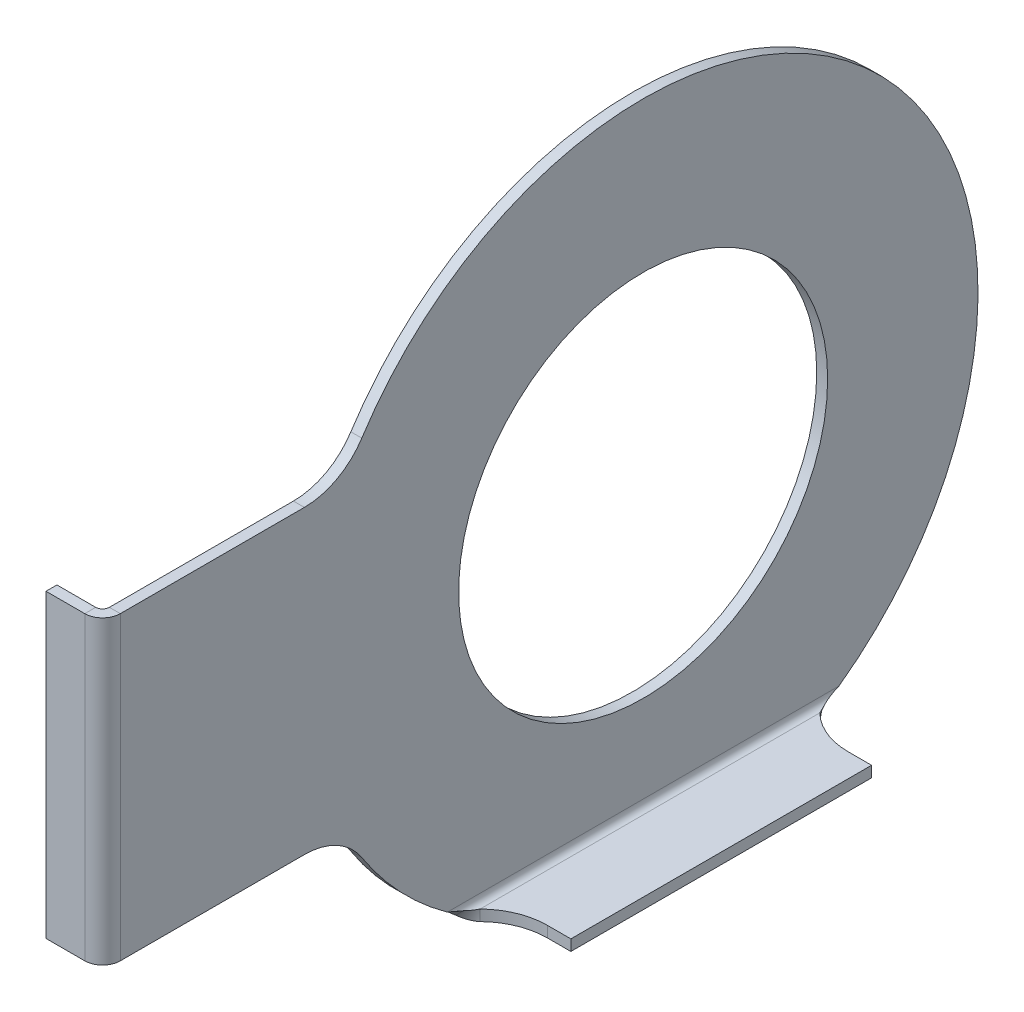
ISO-10303-21;
HEADER;
FILE_DESCRIPTION(('STEP AP214'),'2;1');
FILE_NAME('part.step','',(''),(''),'','','');
FILE_SCHEMA(('AUTOMOTIVE_DESIGN { 1 0 10303 214 1 1 1 1 }'));
ENDSEC;
DATA;
#1=APPLICATION_CONTEXT('core data for automotive mechanical design processes');
#2=APPLICATION_PROTOCOL_DEFINITION('international standard','automotive_design',2000,#1);
#3=PRODUCT_CONTEXT('',#1,'mechanical');
#4=PRODUCT('Part','Part','',(#3));
#5=PRODUCT_RELATED_PRODUCT_CATEGORY('part','',(#4));
#6=PRODUCT_DEFINITION_FORMATION('','',#4);
#7=PRODUCT_DEFINITION_CONTEXT('part definition',#1,'design');
#8=PRODUCT_DEFINITION('design','',#6,#7);
#9=PRODUCT_DEFINITION_SHAPE('','',#8);
#10=(LENGTH_UNIT() NAMED_UNIT(*) SI_UNIT(.MILLI.,.METRE.));
#11=(NAMED_UNIT(*) PLANE_ANGLE_UNIT() SI_UNIT($,.RADIAN.));
#12=(NAMED_UNIT(*) SI_UNIT($,.STERADIAN.) SOLID_ANGLE_UNIT());
#13=UNCERTAINTY_MEASURE_WITH_UNIT(LENGTH_MEASURE(1.E-05),#10,'distance_accuracy_value','');
#14=(GEOMETRIC_REPRESENTATION_CONTEXT(3) GLOBAL_UNCERTAINTY_ASSIGNED_CONTEXT((#13)) GLOBAL_UNIT_ASSIGNED_CONTEXT((#10,
#11,#12)) REPRESENTATION_CONTEXT('',''));
#15=CARTESIAN_POINT('',(0.,0.,0.));
#16=DIRECTION('',(0.,0.,1.));
#17=DIRECTION('',(1.,0.,0.));
#18=AXIS2_PLACEMENT_3D('',#15,#16,#17);
#19=CARTESIAN_POINT('',(0.,32.,49.5681349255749));
#20=DIRECTION('',(-1.,0.,0.));
#21=DIRECTION('',(0.,0.,1.));
#22=AXIS2_PLACEMENT_3D('',#19,#20,#21);
#23=PLANE('',#22);
#24=CARTESIAN_POINT('',(0.,0.,0.));
#25=DIRECTION('',(1.,0.,0.));
#26=DIRECTION('',(0.,0.,-1.));
#27=AXIS2_PLACEMENT_3D('',#24,#25,#26);
#28=CIRCLE('',#27,27.);
#29=CARTESIAN_POINT('',(0.,0.,-27.));
#30=VERTEX_POINT('',#29);
#31=EDGE_CURVE('E659',#30,#30,#28,.T.);
#32=ORIENTED_EDGE('',*,*,#31,.T.);
#33=EDGE_LOOP('',(#32));
#34=FACE_BOUND('',#33,.T.);
#35=DIRECTION('',(0.,0.,-1.));
#36=VECTOR('',#35,1.);
#37=CARTESIAN_POINT('',(0.,-22.,49.5681349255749));
#38=LINE('',#37,#36);
#39=CARTESIAN_POINT('',(0.,-22.,76.5));
#40=VERTEX_POINT('',#39);
#41=CARTESIAN_POINT('',(0.,-22.,49.5681349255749));
#42=VERTEX_POINT('',#41);
#43=EDGE_CURVE('E85',#40,#42,#38,.T.);
#44=ORIENTED_EDGE('',*,*,#43,.F.);
#45=DIRECTION('',(0.,1.,0.));
#46=VECTOR('',#45,1.);
#47=CARTESIAN_POINT('',(0.,32.,76.5));
#48=LINE('',#47,#46);
#49=CARTESIAN_POINT('',(0.,22.,76.5));
#50=VERTEX_POINT('',#49);
#51=EDGE_CURVE('E77',#40,#50,#48,.T.);
#52=ORIENTED_EDGE('',*,*,#51,.T.);
#53=DIRECTION('',(0.,0.,1.));
#54=VECTOR('',#53,1.);
#55=CARTESIAN_POINT('',(0.,22.,49.5681349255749));
#56=LINE('',#55,#54);
#57=CARTESIAN_POINT('',(0.,22.,49.5681349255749));
#58=VERTEX_POINT('',#57);
#59=EDGE_CURVE('E93',#58,#50,#56,.T.);
#60=ORIENTED_EDGE('',*,*,#59,.F.);
#61=CARTESIAN_POINT('',(0.,32.,49.5681349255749));
#62=DIRECTION('',(-1.,0.,0.));
#63=DIRECTION('',(0.,0.,1.));
#64=AXIS2_PLACEMENT_3D('',#61,#62,#63);
#65=CIRCLE('',#64,10.);
#66=CARTESIAN_POINT('',(0.,26.5762711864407,41.16675612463));
#67=VERTEX_POINT('',#66);
#68=EDGE_CURVE('E635',#67,#58,#65,.T.);
#69=ORIENTED_EDGE('',*,*,#68,.F.);
#70=CARTESIAN_POINT('',(0.,0.,0.));
#71=DIRECTION('',(1.,0.,0.));
#72=DIRECTION('',(0.,0.,-1.));
#73=AXIS2_PLACEMENT_3D('',#70,#71,#72);
#74=CIRCLE('',#73,49.);
#75=CARTESIAN_POINT('',(0.,-39.75,-28.6520069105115));
#76=VERTEX_POINT('',#75);
#77=EDGE_CURVE('E525',#76,#67,#74,.T.);
#78=ORIENTED_EDGE('',*,*,#77,.F.);
#79=DIRECTION('',(0.,0.,1.));
#80=VECTOR('',#79,1.);
#81=CARTESIAN_POINT('',(0.,-39.75,49.5681349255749));
#82=LINE('',#81,#80);
#83=CARTESIAN_POINT('',(0.,-39.75,28.6520069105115));
#84=VERTEX_POINT('',#83);
#85=EDGE_CURVE('E491',#76,#84,#82,.T.);
#86=ORIENTED_EDGE('',*,*,#85,.T.);
#87=CARTESIAN_POINT('',(0.,0.,0.));
#88=DIRECTION('',(1.,0.,0.));
#89=DIRECTION('',(0.,0.,-1.));
#90=AXIS2_PLACEMENT_3D('',#87,#88,#89);
#91=CIRCLE('',#90,49.);
#92=CARTESIAN_POINT('',(0.,-26.5762711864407,41.16675612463));
#93=VERTEX_POINT('',#92);
#94=EDGE_CURVE('E650',#93,#84,#91,.T.);
#95=ORIENTED_EDGE('',*,*,#94,.F.);
#96=CARTESIAN_POINT('',(0.,-32.,49.5681349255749));
#97=DIRECTION('',(-1.,0.,0.));
#98=DIRECTION('',(0.,0.,-1.));
#99=AXIS2_PLACEMENT_3D('',#96,#97,#98);
#100=CIRCLE('',#99,10.);
#101=EDGE_CURVE('E477',#42,#93,#100,.T.);
#102=ORIENTED_EDGE('',*,*,#101,.F.);
#103=EDGE_LOOP('',(#44,#52,#60,#69,#78,#86,#95,#102));
#104=FACE_BOUND('',#103,.T.);
#105=ADVANCED_FACE('F68',(#34,#104),#23,.T.);
#106=CARTESIAN_POINT('',(9.59070153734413,-40.75,-32.));
#107=DIRECTION('',(0.,-1.,0.));
#108=DIRECTION('',(0.,0.,1.));
#109=AXIS2_PLACEMENT_3D('',#106,#107,#108);
#110=CYLINDRICAL_SURFACE('',#109,10.);
#111=CARTESIAN_POINT('',(9.59070153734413,-42.35,-32.));
#112=DIRECTION('',(0.,-1.,0.));
#113=DIRECTION('',(0.,0.,-1.));
#114=AXIS2_PLACEMENT_3D('',#111,#112,#113);
#115=CIRCLE('',#114,10.);
#116=CARTESIAN_POINT('',(9.59070153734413,-42.35,-22.));
#117=VERTEX_POINT('',#116);
#118=CARTESIAN_POINT('',(2.60000000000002,-42.35,-24.8494691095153));
#119=VERTEX_POINT('',#118);
#120=EDGE_CURVE('E544',#117,#119,#115,.T.);
#121=ORIENTED_EDGE('',*,*,#120,.T.);
#122=CARTESIAN_POINT('',(2.60000000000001,-40.75,-24.8494691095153));
#123=CARTESIAN_POINT('',(2.60000000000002,-42.35,-24.8494691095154));
#124=B_SPLINE_CURVE_WITH_KNOTS('',1,(#122,#123),.UNSPECIFIED.,.F.,.F.,(2,2),(0.,1.),.UNSPECIFIED.);
#125=CARTESIAN_POINT('',(2.60000000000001,-40.75,-24.8494691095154));
#126=VERTEX_POINT('',#125);
#127=EDGE_CURVE('E340',#119,#126,#124,.F.);
#128=ORIENTED_EDGE('',*,*,#127,.T.);
#129=CARTESIAN_POINT('',(9.59070153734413,-40.75,-32.));
#130=DIRECTION('',(0.,-1.,0.));
#131=DIRECTION('',(0.,0.,-1.));
#132=AXIS2_PLACEMENT_3D('',#129,#130,#131);
#133=CIRCLE('',#132,10.);
#134=CARTESIAN_POINT('',(9.59070153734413,-40.75,-22.));
#135=VERTEX_POINT('',#134);
#136=EDGE_CURVE('E536',#135,#126,#133,.T.);
#137=ORIENTED_EDGE('',*,*,#136,.F.);
#138=DIRECTION('',(0.,-1.,0.));
#139=VECTOR('',#138,1.);
#140=CARTESIAN_POINT('',(9.59070153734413,-40.75,-22.));
#141=LINE('',#140,#139);
#142=EDGE_CURVE('E545',#135,#117,#141,.T.);
#143=ORIENTED_EDGE('',*,*,#142,.T.);
#144=EDGE_LOOP('',(#121,#128,#137,#143));
#145=FACE_BOUND('',#144,.T.);
#146=ADVANCED_FACE('F576',(#145),#110,.F.);
#147=CARTESIAN_POINT('',(9.59070153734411,-40.75,32.));
#148=DIRECTION('',(0.,-1.,0.));
#149=DIRECTION('',(0.,0.,1.));
#150=AXIS2_PLACEMENT_3D('',#147,#148,#149);
#151=CYLINDRICAL_SURFACE('',#150,10.);
#152=CARTESIAN_POINT('',(9.59070153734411,-40.75,32.));
#153=DIRECTION('',(0.,-1.,0.));
#154=DIRECTION('',(0.,0.,-1.));
#155=AXIS2_PLACEMENT_3D('',#152,#153,#154);
#156=CIRCLE('',#155,10.);
#157=CARTESIAN_POINT('',(2.6,-40.75,24.8494691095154));
#158=VERTEX_POINT('',#157);
#159=CARTESIAN_POINT('',(9.59070153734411,-40.75,22.));
#160=VERTEX_POINT('',#159);
#161=EDGE_CURVE('E532',#158,#160,#156,.T.);
#162=ORIENTED_EDGE('',*,*,#161,.F.);
#163=CARTESIAN_POINT('',(2.60000000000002,-42.35,24.8494691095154));
#164=CARTESIAN_POINT('',(2.60000000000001,-40.75,24.8494691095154));
#165=B_SPLINE_CURVE_WITH_KNOTS('',1,(#163,#164),.UNSPECIFIED.,.F.,.F.,(2,2),(0.,1.),.UNSPECIFIED.);
#166=CARTESIAN_POINT('',(2.60000000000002,-42.35,24.8494691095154));
#167=VERTEX_POINT('',#166);
#168=EDGE_CURVE('E413',#158,#167,#165,.F.);
#169=ORIENTED_EDGE('',*,*,#168,.T.);
#170=CARTESIAN_POINT('',(9.59070153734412,-42.35,32.));
#171=DIRECTION('',(0.,-1.,0.));
#172=DIRECTION('',(0.,0.,-1.));
#173=AXIS2_PLACEMENT_3D('',#170,#171,#172);
#174=CIRCLE('',#173,10.);
#175=CARTESIAN_POINT('',(9.59070153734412,-42.35,22.));
#176=VERTEX_POINT('',#175);
#177=EDGE_CURVE('E540',#167,#176,#174,.T.);
#178=ORIENTED_EDGE('',*,*,#177,.T.);
#179=DIRECTION('',(0.,-1.,0.));
#180=VECTOR('',#179,1.);
#181=CARTESIAN_POINT('',(9.59070153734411,-40.75,22.));
#182=LINE('',#181,#180);
#183=EDGE_CURVE('E554',#160,#176,#182,.T.);
#184=ORIENTED_EDGE('',*,*,#183,.F.);
#185=EDGE_LOOP('',(#162,#169,#178,#184));
#186=FACE_BOUND('',#185,.T.);
#187=ADVANCED_FACE('F586',(#186),#151,.F.);
#188=CARTESIAN_POINT('',(-71.9774333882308,-40.7500000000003,49.5681349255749));
#189=DIRECTION('',(0.,-1.,0.));
#190=DIRECTION('',(0.,0.,1.));
#191=AXIS2_PLACEMENT_3D('',#188,#189,#190);
#192=PLANE('',#191);
#193=ORIENTED_EDGE('',*,*,#136,.T.);
#194=DIRECTION('',(0.,0.,1.));
#195=VECTOR('',#194,1.);
#196=CARTESIAN_POINT('',(2.59999999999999,-40.75,49.5681349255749));
#197=LINE('',#196,#195);
#198=EDGE_CURVE('E557',#126,#158,#197,.T.);
#199=ORIENTED_EDGE('',*,*,#198,.T.);
#200=ORIENTED_EDGE('',*,*,#161,.T.);
#201=DIRECTION('',(1.,0.,0.));
#202=VECTOR('',#201,1.);
#203=CARTESIAN_POINT('',(9.59070153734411,-40.75,22.));
#204=LINE('',#203,#202);
#205=CARTESIAN_POINT('',(13.0225666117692,-40.75,22.));
#206=VERTEX_POINT('',#205);
#207=EDGE_CURVE('E529',#160,#206,#204,.T.);
#208=ORIENTED_EDGE('',*,*,#207,.T.);
#209=DIRECTION('',(0.,0.,-1.));
#210=VECTOR('',#209,1.);
#211=CARTESIAN_POINT('',(13.0225666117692,-40.75,22.));
#212=LINE('',#211,#210);
#213=CARTESIAN_POINT('',(13.0225666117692,-40.75,-22.));
#214=VERTEX_POINT('',#213);
#215=EDGE_CURVE('E531',#206,#214,#212,.T.);
#216=ORIENTED_EDGE('',*,*,#215,.T.);
#217=DIRECTION('',(-1.,0.,0.));
#218=VECTOR('',#217,1.);
#219=CARTESIAN_POINT('',(9.59070153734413,-40.75,-22.));
#220=LINE('',#219,#218);
#221=EDGE_CURVE('E534',#214,#135,#220,.T.);
#222=ORIENTED_EDGE('',*,*,#221,.T.);
#223=EDGE_LOOP('',(#193,#199,#200,#208,#216,#222));
#224=FACE_BOUND('',#223,.T.);
#225=ADVANCED_FACE('F587',(#224),#192,.F.);
#226=CARTESIAN_POINT('',(-71.9774333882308,-42.3500000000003,49.5681349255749));
#227=DIRECTION('',(0.,-1.,0.));
#228=DIRECTION('',(0.,0.,1.));
#229=AXIS2_PLACEMENT_3D('',#226,#227,#228);
#230=PLANE('',#229);
#231=DIRECTION('',(0.,0.,1.));
#232=VECTOR('',#231,1.);
#233=CARTESIAN_POINT('',(2.6,-42.35,49.5681349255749));
#234=LINE('',#233,#232);
#235=EDGE_CURVE('E1003',#119,#167,#234,.T.);
#236=ORIENTED_EDGE('',*,*,#235,.F.);
#237=ORIENTED_EDGE('',*,*,#120,.F.);
#238=DIRECTION('',(-1.,0.,0.));
#239=VECTOR('',#238,1.);
#240=CARTESIAN_POINT('',(9.59070153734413,-42.35,-22.));
#241=LINE('',#240,#239);
#242=CARTESIAN_POINT('',(13.0225666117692,-42.35,-22.));
#243=VERTEX_POINT('',#242);
#244=EDGE_CURVE('E542',#243,#117,#241,.T.);
#245=ORIENTED_EDGE('',*,*,#244,.F.);
#246=DIRECTION('',(0.,0.,-1.));
#247=VECTOR('',#246,1.);
#248=CARTESIAN_POINT('',(13.0225666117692,-42.35,22.));
#249=LINE('',#248,#247);
#250=CARTESIAN_POINT('',(13.0225666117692,-42.35,22.));
#251=VERTEX_POINT('',#250);
#252=EDGE_CURVE('E539',#251,#243,#249,.T.);
#253=ORIENTED_EDGE('',*,*,#252,.F.);
#254=DIRECTION('',(1.,0.,0.));
#255=VECTOR('',#254,1.);
#256=CARTESIAN_POINT('',(9.59070153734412,-42.35,22.));
#257=LINE('',#256,#255);
#258=EDGE_CURVE('E537',#176,#251,#257,.T.);
#259=ORIENTED_EDGE('',*,*,#258,.F.);
#260=ORIENTED_EDGE('',*,*,#177,.F.);
#261=EDGE_LOOP('',(#236,#237,#245,#253,#259,#260));
#262=FACE_BOUND('',#261,.T.);
#263=ADVANCED_FACE('F589',(#262),#230,.T.);
#264=CARTESIAN_POINT('',(9.59070153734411,-40.75,22.));
#265=DIRECTION('',(0.,0.,-1.));
#266=DIRECTION('',(0.,-1.,0.));
#267=AXIS2_PLACEMENT_3D('',#264,#265,#266);
#268=PLANE('',#267);
#269=ORIENTED_EDGE('',*,*,#258,.T.);
#270=DIRECTION('',(0.,-1.,0.));
#271=VECTOR('',#270,1.);
#272=CARTESIAN_POINT('',(13.0225666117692,-40.75,22.));
#273=LINE('',#272,#271);
#274=EDGE_CURVE('E551',#206,#251,#273,.T.);
#275=ORIENTED_EDGE('',*,*,#274,.F.);
#276=ORIENTED_EDGE('',*,*,#207,.F.);
#277=ORIENTED_EDGE('',*,*,#183,.T.);
#278=EDGE_LOOP('',(#269,#275,#276,#277));
#279=FACE_BOUND('',#278,.T.);
#280=ADVANCED_FACE('F592',(#279),#268,.F.);
#281=CARTESIAN_POINT('',(13.0225666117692,-40.75,22.));
#282=DIRECTION('',(-1.,0.,0.));
#283=DIRECTION('',(0.,0.,1.));
#284=AXIS2_PLACEMENT_3D('',#281,#282,#283);
#285=PLANE('',#284);
#286=ORIENTED_EDGE('',*,*,#252,.T.);
#287=DIRECTION('',(0.,-1.,0.));
#288=VECTOR('',#287,1.);
#289=CARTESIAN_POINT('',(13.0225666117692,-40.75,-22.));
#290=LINE('',#289,#288);
#291=EDGE_CURVE('E548',#214,#243,#290,.T.);
#292=ORIENTED_EDGE('',*,*,#291,.F.);
#293=ORIENTED_EDGE('',*,*,#215,.F.);
#294=ORIENTED_EDGE('',*,*,#274,.T.);
#295=EDGE_LOOP('',(#286,#292,#293,#294));
#296=FACE_BOUND('',#295,.T.);
#297=ADVANCED_FACE('F680',(#296),#285,.F.);
#298=CARTESIAN_POINT('',(9.59070153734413,-40.75,-22.));
#299=DIRECTION('',(0.,0.,1.));
#300=DIRECTION('',(0.,1.,0.));
#301=AXIS2_PLACEMENT_3D('',#298,#299,#300);
#302=PLANE('',#301);
#303=ORIENTED_EDGE('',*,*,#244,.T.);
#304=ORIENTED_EDGE('',*,*,#142,.F.);
#305=ORIENTED_EDGE('',*,*,#221,.F.);
#306=ORIENTED_EDGE('',*,*,#291,.T.);
#307=EDGE_LOOP('',(#303,#304,#305,#306));
#308=FACE_BOUND('',#307,.T.);
#309=ADVANCED_FACE('F510',(#308),#302,.F.);
#310=CARTESIAN_POINT('',(1.6,0.,0.));
#311=DIRECTION('',(-1.,0.,0.));
#312=DIRECTION('',(0.,0.,1.));
#313=AXIS2_PLACEMENT_3D('',#310,#311,#312);
#314=CYLINDRICAL_SURFACE('',#313,27.);
#315=CARTESIAN_POINT('',(1.6,0.,0.));
#316=DIRECTION('',(1.,0.,0.));
#317=DIRECTION('',(0.,0.,-1.));
#318=AXIS2_PLACEMENT_3D('',#315,#316,#317);
#319=CIRCLE('',#318,27.);
#320=CARTESIAN_POINT('',(1.6,0.,-27.));
#321=VERTEX_POINT('',#320);
#322=EDGE_CURVE('E474',#321,#321,#319,.T.);
#323=ORIENTED_EDGE('',*,*,#322,.T.);
#324=EDGE_LOOP('',(#323));
#325=FACE_BOUND('',#324,.T.);
#326=ORIENTED_EDGE('',*,*,#31,.F.);
#327=EDGE_LOOP('',(#326));
#328=FACE_BOUND('',#327,.T.);
#329=ADVANCED_FACE('F673',(#325,#328),#314,.F.);
#330=CARTESIAN_POINT('',(1.6,-32.,49.5681349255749));
#331=DIRECTION('',(-1.,0.,0.));
#332=DIRECTION('',(0.,0.,1.));
#333=AXIS2_PLACEMENT_3D('',#330,#331,#332);
#334=CYLINDRICAL_SURFACE('',#333,10.);
#335=ORIENTED_EDGE('',*,*,#101,.T.);
#336=DIRECTION('',(-1.,0.,0.));
#337=VECTOR('',#336,1.);
#338=CARTESIAN_POINT('',(1.6,-26.5762711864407,41.16675612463));
#339=LINE('',#338,#337);
#340=CARTESIAN_POINT('',(1.6,-26.5762711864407,41.16675612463));
#341=VERTEX_POINT('',#340);
#342=EDGE_CURVE('E646',#341,#93,#339,.T.);
#343=ORIENTED_EDGE('',*,*,#342,.F.);
#344=CARTESIAN_POINT('',(1.6,-32.,49.5681349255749));
#345=DIRECTION('',(-1.,0.,0.));
#346=DIRECTION('',(0.,0.,-1.));
#347=AXIS2_PLACEMENT_3D('',#344,#345,#346);
#348=CIRCLE('',#347,10.);
#349=CARTESIAN_POINT('',(1.6,-22.,49.5681349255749));
#350=VERTEX_POINT('',#349);
#351=EDGE_CURVE('E526',#350,#341,#348,.T.);
#352=ORIENTED_EDGE('',*,*,#351,.F.);
#353=DIRECTION('',(-1.,0.,0.));
#354=VECTOR('',#353,1.);
#355=CARTESIAN_POINT('',(1.6,-22.,49.5681349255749));
#356=LINE('',#355,#354);
#357=EDGE_CURVE('E618',#350,#42,#356,.T.);
#358=ORIENTED_EDGE('',*,*,#357,.T.);
#359=EDGE_LOOP('',(#335,#343,#352,#358));
#360=FACE_BOUND('',#359,.T.);
#361=ADVANCED_FACE('F644',(#360),#334,.F.);
#362=CARTESIAN_POINT('',(1.6,-22.,49.5681349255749));
#363=DIRECTION('',(0.,1.,0.));
#364=DIRECTION('',(0.,0.,1.));
#365=AXIS2_PLACEMENT_3D('',#362,#363,#364);
#366=PLANE('',#365);
#367=DIRECTION('',(1.,0.,0.));
#368=VECTOR('',#367,1.);
#369=CARTESIAN_POINT('',(1.6,-22.,76.5));
#370=LINE('',#369,#368);
#371=CARTESIAN_POINT('',(1.6,-22.,76.5));
#372=VERTEX_POINT('',#371);
#373=EDGE_CURVE('E12',#40,#372,#370,.T.);
#374=ORIENTED_EDGE('',*,*,#373,.F.);
#375=ORIENTED_EDGE('',*,*,#43,.T.);
#376=ORIENTED_EDGE('',*,*,#357,.F.);
#377=DIRECTION('',(0.,0.,-1.));
#378=VECTOR('',#377,1.);
#379=CARTESIAN_POINT('',(1.6,-22.,49.5681349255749));
#380=LINE('',#379,#378);
#381=EDGE_CURVE('E72',#372,#350,#380,.T.);
#382=ORIENTED_EDGE('',*,*,#381,.F.);
#383=EDGE_LOOP('',(#374,#375,#376,#382));
#384=FACE_BOUND('',#383,.T.);
#385=ADVANCED_FACE('F70',(#384),#366,.F.);
#386=CARTESIAN_POINT('',(1.6,22.,49.5681349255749));
#387=DIRECTION('',(0.,-1.,0.));
#388=DIRECTION('',(0.,0.,-1.));
#389=AXIS2_PLACEMENT_3D('',#386,#387,#388);
#390=PLANE('',#389);
#391=DIRECTION('',(-1.,0.,0.));
#392=VECTOR('',#391,1.);
#393=CARTESIAN_POINT('',(1.6,22.,76.5));
#394=LINE('',#393,#392);
#395=CARTESIAN_POINT('',(1.6,22.,76.5));
#396=VERTEX_POINT('',#395);
#397=EDGE_CURVE('E613',#396,#50,#394,.T.);
#398=ORIENTED_EDGE('',*,*,#397,.F.);
#399=DIRECTION('',(0.,0.,1.));
#400=VECTOR('',#399,1.);
#401=CARTESIAN_POINT('',(1.6,22.,49.5681349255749));
#402=LINE('',#401,#400);
#403=CARTESIAN_POINT('',(1.6,22.,49.5681349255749));
#404=VERTEX_POINT('',#403);
#405=EDGE_CURVE('E620',#404,#396,#402,.T.);
#406=ORIENTED_EDGE('',*,*,#405,.F.);
#407=DIRECTION('',(-1.,0.,0.));
#408=VECTOR('',#407,1.);
#409=CARTESIAN_POINT('',(1.6,22.,49.5681349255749));
#410=LINE('',#409,#408);
#411=EDGE_CURVE('E619',#404,#58,#410,.T.);
#412=ORIENTED_EDGE('',*,*,#411,.T.);
#413=ORIENTED_EDGE('',*,*,#59,.T.);
#414=EDGE_LOOP('',(#398,#406,#412,#413));
#415=FACE_BOUND('',#414,.T.);
#416=ADVANCED_FACE('F685',(#415),#390,.F.);
#417=CARTESIAN_POINT('',(1.6,32.,49.5681349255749));
#418=DIRECTION('',(-1.,0.,0.));
#419=DIRECTION('',(0.,0.,1.));
#420=AXIS2_PLACEMENT_3D('',#417,#418,#419);
#421=CYLINDRICAL_SURFACE('',#420,10.);
#422=ORIENTED_EDGE('',*,*,#68,.T.);
#423=ORIENTED_EDGE('',*,*,#411,.F.);
#424=CARTESIAN_POINT('',(1.6,32.,49.5681349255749));
#425=DIRECTION('',(-1.,0.,0.));
#426=DIRECTION('',(0.,0.,1.));
#427=AXIS2_PLACEMENT_3D('',#424,#425,#426);
#428=CIRCLE('',#427,10.);
#429=CARTESIAN_POINT('',(1.6,26.5762711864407,41.16675612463));
#430=VERTEX_POINT('',#429);
#431=EDGE_CURVE('E621',#430,#404,#428,.T.);
#432=ORIENTED_EDGE('',*,*,#431,.F.);
#433=DIRECTION('',(-1.,0.,0.));
#434=VECTOR('',#433,1.);
#435=CARTESIAN_POINT('',(1.6,26.5762711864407,41.16675612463));
#436=LINE('',#435,#434);
#437=EDGE_CURVE('E629',#430,#67,#436,.T.);
#438=ORIENTED_EDGE('',*,*,#437,.T.);
#439=EDGE_LOOP('',(#422,#423,#432,#438));
#440=FACE_BOUND('',#439,.T.);
#441=ADVANCED_FACE('F504',(#440),#421,.F.);
#442=CARTESIAN_POINT('',(1.6,32.,49.5681349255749));
#443=DIRECTION('',(-1.,0.,0.));
#444=DIRECTION('',(0.,0.,1.));
#445=AXIS2_PLACEMENT_3D('',#442,#443,#444);
#446=PLANE('',#445);
#447=DIRECTION('',(0.,1.,0.));
#448=VECTOR('',#447,1.);
#449=CARTESIAN_POINT('',(1.6,32.,76.5));
#450=LINE('',#449,#448);
#451=EDGE_CURVE('E605',#372,#396,#450,.T.);
#452=ORIENTED_EDGE('',*,*,#451,.F.);
#453=ORIENTED_EDGE('',*,*,#381,.T.);
#454=ORIENTED_EDGE('',*,*,#351,.T.);
#455=CARTESIAN_POINT('',(1.6,0.,0.));
#456=DIRECTION('',(1.,0.,0.));
#457=DIRECTION('',(0.,0.,-1.));
#458=AXIS2_PLACEMENT_3D('',#455,#456,#457);
#459=CIRCLE('',#458,49.);
#460=CARTESIAN_POINT('',(1.6,-39.75,28.6520069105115));
#461=VERTEX_POINT('',#460);
#462=EDGE_CURVE('E518',#341,#461,#459,.T.);
#463=ORIENTED_EDGE('',*,*,#462,.T.);
#464=DIRECTION('',(0.,0.,1.));
#465=VECTOR('',#464,1.);
#466=CARTESIAN_POINT('',(1.6,-39.75,49.5681349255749));
#467=LINE('',#466,#465);
#468=CARTESIAN_POINT('',(1.6,-39.75,-28.6520069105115));
#469=VERTEX_POINT('',#468);
#470=EDGE_CURVE('E300',#469,#461,#467,.T.);
#471=ORIENTED_EDGE('',*,*,#470,.F.);
#472=CARTESIAN_POINT('',(1.6,0.,0.));
#473=DIRECTION('',(1.,0.,0.));
#474=DIRECTION('',(0.,0.,-1.));
#475=AXIS2_PLACEMENT_3D('',#472,#473,#474);
#476=CIRCLE('',#475,49.);
#477=EDGE_CURVE('E625',#469,#430,#476,.T.);
#478=ORIENTED_EDGE('',*,*,#477,.T.);
#479=ORIENTED_EDGE('',*,*,#431,.T.);
#480=ORIENTED_EDGE('',*,*,#405,.T.);
#481=EDGE_LOOP('',(#452,#453,#454,#463,#471,#478,#479,#480));
#482=FACE_BOUND('',#481,.T.);
#483=ORIENTED_EDGE('',*,*,#322,.F.);
#484=EDGE_LOOP('',(#483));
#485=FACE_BOUND('',#484,.T.);
#486=ADVANCED_FACE('F503',(#482,#485),#446,.F.);
#487=CARTESIAN_POINT('',(1.6,0.,0.));
#488=DIRECTION('',(-1.,0.,0.));
#489=DIRECTION('',(0.,0.,1.));
#490=AXIS2_PLACEMENT_3D('',#487,#488,#489);
#491=CYLINDRICAL_SURFACE('',#490,49.);
#492=CARTESIAN_POINT('',(0.,-39.75,-28.6520069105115));
#493=CARTESIAN_POINT('',(1.6,-39.75,-28.6520069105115));
#494=B_SPLINE_CURVE_WITH_KNOTS('',1,(#492,#493),.UNSPECIFIED.,.F.,.F.,(2,2),(0.,1.),.UNSPECIFIED.);
#495=EDGE_CURVE('E463',#76,#469,#494,.T.);
#496=ORIENTED_EDGE('',*,*,#495,.F.);
#497=ORIENTED_EDGE('',*,*,#77,.T.);
#498=ORIENTED_EDGE('',*,*,#437,.F.);
#499=ORIENTED_EDGE('',*,*,#477,.F.);
#500=EDGE_LOOP('',(#496,#497,#498,#499));
#501=FACE_BOUND('',#500,.T.);
#502=ADVANCED_FACE('F493',(#501),#491,.T.);
#503=CARTESIAN_POINT('',(1.6,0.,0.));
#504=DIRECTION('',(-1.,0.,0.));
#505=DIRECTION('',(0.,0.,1.));
#506=AXIS2_PLACEMENT_3D('',#503,#504,#505);
#507=CYLINDRICAL_SURFACE('',#506,49.);
#508=CARTESIAN_POINT('',(1.6,-39.75,28.6520069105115));
#509=CARTESIAN_POINT('',(0.,-39.75,28.6520069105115));
#510=B_SPLINE_CURVE_WITH_KNOTS('',1,(#508,#509),.UNSPECIFIED.,.F.,.F.,(2,2),(0.,1.),.UNSPECIFIED.);
#511=EDGE_CURVE('E475',#461,#84,#510,.T.);
#512=ORIENTED_EDGE('',*,*,#511,.F.);
#513=ORIENTED_EDGE('',*,*,#462,.F.);
#514=ORIENTED_EDGE('',*,*,#342,.T.);
#515=ORIENTED_EDGE('',*,*,#94,.T.);
#516=EDGE_LOOP('',(#512,#513,#514,#515));
#517=FACE_BOUND('',#516,.T.);
#518=ADVANCED_FACE('F367',(#517),#507,.T.);
#519=CARTESIAN_POINT('',(2.60000000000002,-42.35,-24.8494691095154));
#520=CARTESIAN_POINT('',(2.26035717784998,-42.35,-25.1372993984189));
#521=CARTESIAN_POINT('',(1.92091750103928,-42.2826231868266,-25.4250698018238));
#522=CARTESIAN_POINT('',(1.29318545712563,-42.0232287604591,-26.0006704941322));
#523=CARTESIAN_POINT('',(1.00519832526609,-41.8313372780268,-26.2884408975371));
#524=CARTESIAN_POINT('',(0.764629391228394,-41.5915794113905,-26.5762711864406));
#525=CARTESIAN_POINT('',(2.60000000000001,-40.75,-24.8494691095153));
#526=CARTESIAN_POINT('',(2.46937774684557,-40.75,-25.1372782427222));
#527=CARTESIAN_POINT('',(2.33881442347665,-40.7240858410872,-25.4250698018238));
#528=CARTESIAN_POINT('',(2.09737902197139,-40.6243187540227,-26.0006704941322));
#529=CARTESIAN_POINT('',(1.98660793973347,-40.5505075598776,-26.2884620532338));
#530=CARTESIAN_POINT('',(1.89408822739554,-40.4582997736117,-26.5762711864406));
#531=B_SPLINE_SURFACE_WITH_KNOTS('',1,3,((#519,#520,#521,#522,#523,#524),(#525,#526,#527,#528,
#529,#530)),.UNSPECIFIED.,.F.,.F.,.F.,(2,2),(4,2,4),(0.,1.),(0.,0.5,1.),.UNSPECIFIED.);
#532=CARTESIAN_POINT('',(2.60000000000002,-42.35,-24.8494691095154));
#533=CARTESIAN_POINT('',(2.26035717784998,-42.35,-25.1372993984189));
#534=CARTESIAN_POINT('',(1.92091750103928,-42.2826231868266,-25.4250698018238));
#535=CARTESIAN_POINT('',(1.29318545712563,-42.0232287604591,-26.0006704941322));
#536=CARTESIAN_POINT('',(1.00519832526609,-41.8313372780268,-26.2884408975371));
#537=CARTESIAN_POINT('',(0.764629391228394,-41.5915794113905,-26.5762711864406));
#538=B_SPLINE_CURVE_WITH_KNOTS('',3,(#532,#533,#534,#535,#536,#537),.UNSPECIFIED.,.F.,.F.,(4,2,
4),(0.,0.5,1.),.UNSPECIFIED.);
#539=CARTESIAN_POINT('',(0.764631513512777,-41.5915815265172,-26.5762686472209));
#540=VERTEX_POINT('',#539);
#541=EDGE_CURVE('E244',#119,#540,#538,.T.);
#542=CARTESIAN_POINT('',(0.764629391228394,-41.5915794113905,-26.5762711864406));
#543=CARTESIAN_POINT('',(1.89408822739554,-40.4582997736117,-26.5762711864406));
#544=B_SPLINE_CURVE_WITH_KNOTS('',1,(#542,#543),.UNSPECIFIED.,.F.,.F.,(2,2),(0.,1.),.UNSPECIFIED.);
#545=CARTESIAN_POINT('',(1.89408822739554,-40.4582997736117,-26.5762711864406));
#546=VERTEX_POINT('',#545);
#547=EDGE_CURVE('E337',#540,#546,#544,.T.);
#548=CARTESIAN_POINT('',(1.89408822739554,-40.4582997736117,-26.5762711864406));
#549=CARTESIAN_POINT('',(1.98660793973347,-40.5505075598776,-26.2884620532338));
#550=CARTESIAN_POINT('',(2.09737902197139,-40.6243187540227,-26.0006704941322));
#551=CARTESIAN_POINT('',(2.33881442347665,-40.7240858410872,-25.4250698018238));
#552=CARTESIAN_POINT('',(2.46937774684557,-40.75,-25.1372782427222));
#553=CARTESIAN_POINT('',(2.60000000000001,-40.75,-24.8494691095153));
#554=B_SPLINE_CURVE_WITH_KNOTS('',3,(#548,#549,#550,#551,#552,#553),.UNSPECIFIED.,.F.,.F.,(4,2,
4),(0.,0.5,1.),.UNSPECIFIED.);
#555=EDGE_CURVE('E303',#126,#546,#554,.F.);
#556=ORIENTED_EDGE('',*,*,#127,.F.);
#557=ORIENTED_EDGE('',*,*,#541,.T.);
#558=ORIENTED_EDGE('',*,*,#547,.T.);
#559=ORIENTED_EDGE('',*,*,#555,.F.);
#560=EDGE_LOOP('',(#556,#557,#558,#559));
#561=FACE_BOUND('',#560,.T.);
#562=ADVANCED_FACE('F336',(#561),#531,.F.);
#563=CARTESIAN_POINT('',(0.764629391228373,-41.5915794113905,-26.5762711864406));
#564=CARTESIAN_POINT('',(0.523027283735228,-41.3507918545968,-26.9222581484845));
#565=CARTESIAN_POINT('',(0.329542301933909,-41.0620027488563,-27.2681830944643));
#566=CARTESIAN_POINT('',(0.0679659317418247,-40.4320064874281,-27.9600950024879));
#567=CARTESIAN_POINT('',(0.,-40.0911014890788,-28.3060199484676));
#568=CARTESIAN_POINT('',(0.,-39.75,-28.6520069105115));
#569=CARTESIAN_POINT('',(1.89408822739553,-40.4582997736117,-26.5762711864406));
#570=CARTESIAN_POINT('',(1.80117054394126,-40.3656953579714,-26.9222350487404));
#571=CARTESIAN_POINT('',(1.72674703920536,-40.2546164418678,-27.2681830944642));
#572=CARTESIAN_POINT('',(1.62614074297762,-40.0123101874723,-27.9600950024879));
#573=CARTESIAN_POINT('',(1.6,-39.8811841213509,-28.3060430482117));
#574=CARTESIAN_POINT('',(1.6,-39.75,-28.6520069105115));
#575=B_SPLINE_SURFACE_WITH_KNOTS('',1,3,((#563,#564,#565,#566,#567,#568),(#569,#570,#571,#572,
#573,#574)),.UNSPECIFIED.,.F.,.F.,.F.,(2,2),(4,2,4),(0.,1.),(0.,0.5,1.),.UNSPECIFIED.);
#576=CARTESIAN_POINT('',(0.764629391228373,-41.5915794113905,-26.5762711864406));
#577=CARTESIAN_POINT('',(0.523027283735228,-41.3507918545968,-26.9222581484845));
#578=CARTESIAN_POINT('',(0.329542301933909,-41.0620027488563,-27.2681830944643));
#579=CARTESIAN_POINT('',(0.0679659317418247,-40.4320064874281,-27.9600950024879));
#580=CARTESIAN_POINT('',(0.,-40.0911014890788,-28.3060199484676));
#581=CARTESIAN_POINT('',(0.,-39.75,-28.6520069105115));
#582=B_SPLINE_CURVE_WITH_KNOTS('',3,(#576,#577,#578,#579,#580,#581),.UNSPECIFIED.,.F.,.F.,(4,2,
4),(0.,0.5,1.),.UNSPECIFIED.);
#583=EDGE_CURVE('E325',#540,#76,#582,.T.);
#584=CARTESIAN_POINT('',(1.6,-39.75,-28.6520069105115));
#585=CARTESIAN_POINT('',(1.6,-39.8811841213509,-28.3060430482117));
#586=CARTESIAN_POINT('',(1.62614074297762,-40.0123101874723,-27.9600950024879));
#587=CARTESIAN_POINT('',(1.72674703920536,-40.2546164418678,-27.2681830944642));
#588=CARTESIAN_POINT('',(1.80117054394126,-40.3656953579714,-26.9222350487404));
#589=CARTESIAN_POINT('',(1.89408822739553,-40.4582997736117,-26.5762711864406));
#590=B_SPLINE_CURVE_WITH_KNOTS('',3,(#584,#585,#586,#587,#588,#589),.UNSPECIFIED.,.F.,.F.,(4,2,
4),(0.,0.5,1.),.UNSPECIFIED.);
#591=EDGE_CURVE('E298',#546,#469,#590,.F.);
#592=ORIENTED_EDGE('',*,*,#547,.F.);
#593=ORIENTED_EDGE('',*,*,#583,.T.);
#594=ORIENTED_EDGE('',*,*,#495,.T.);
#595=ORIENTED_EDGE('',*,*,#591,.F.);
#596=EDGE_LOOP('',(#592,#593,#594,#595));
#597=FACE_BOUND('',#596,.T.);
#598=ADVANCED_FACE('F366',(#597),#575,.F.);
#599=CARTESIAN_POINT('',(0.,-39.75,28.6520069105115));
#600=CARTESIAN_POINT('',(0.,-40.0911014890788,28.3060199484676));
#601=CARTESIAN_POINT('',(0.0679659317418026,-40.4320064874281,27.9600950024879));
#602=CARTESIAN_POINT('',(0.329542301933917,-41.0620027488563,27.2681830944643));
#603=CARTESIAN_POINT('',(0.523027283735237,-41.3507918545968,26.9222581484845));
#604=CARTESIAN_POINT('',(0.764629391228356,-41.5915794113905,26.5762711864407));
#605=CARTESIAN_POINT('',(1.6,-39.75,28.6520069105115));
#606=CARTESIAN_POINT('',(1.6,-39.8811841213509,28.3060430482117));
#607=CARTESIAN_POINT('',(1.62614074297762,-40.0123101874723,27.9600950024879));
#608=CARTESIAN_POINT('',(1.72674703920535,-40.2546164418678,27.2681830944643));
#609=CARTESIAN_POINT('',(1.80117054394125,-40.3656953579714,26.9222350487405));
#610=CARTESIAN_POINT('',(1.89408822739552,-40.4582997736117,26.5762711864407));
#611=B_SPLINE_SURFACE_WITH_KNOTS('',1,3,((#599,#600,#601,#602,#603,#604),(#605,#606,#607,#608,
#609,#610)),.UNSPECIFIED.,.F.,.F.,.F.,(2,2),(4,2,4),(0.,1.),(0.,0.5,1.),.UNSPECIFIED.);
#612=CARTESIAN_POINT('',(0.,-39.75,28.6520069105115));
#613=CARTESIAN_POINT('',(0.,-40.0911014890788,28.3060199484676));
#614=CARTESIAN_POINT('',(0.0679659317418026,-40.4320064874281,27.9600950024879));
#615=CARTESIAN_POINT('',(0.329542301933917,-41.0620027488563,27.2681830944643));
#616=CARTESIAN_POINT('',(0.523027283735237,-41.3507918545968,26.9222581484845));
#617=CARTESIAN_POINT('',(0.764629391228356,-41.5915794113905,26.5762711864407));
#618=B_SPLINE_CURVE_WITH_KNOTS('',3,(#612,#613,#614,#615,#616,#617),.UNSPECIFIED.,.F.,.F.,(4,2,
4),(0.,0.5,1.),.UNSPECIFIED.);
#619=CARTESIAN_POINT('',(0.764627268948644,-41.5915772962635,26.5762742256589));
#620=VERTEX_POINT('',#619);
#621=EDGE_CURVE('E318',#84,#620,#618,.T.);
#622=CARTESIAN_POINT('',(0.764629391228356,-41.5915794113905,26.5762711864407));
#623=CARTESIAN_POINT('',(1.89408822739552,-40.4582997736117,26.5762711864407));
#624=B_SPLINE_CURVE_WITH_KNOTS('',1,(#622,#623),.UNSPECIFIED.,.F.,.F.,(2,2),(0.,1.),.UNSPECIFIED.);
#625=CARTESIAN_POINT('',(1.89408822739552,-40.4582997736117,26.5762711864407));
#626=VERTEX_POINT('',#625);
#627=EDGE_CURVE('E424',#620,#626,#624,.T.);
#628=CARTESIAN_POINT('',(1.89408822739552,-40.4582997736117,26.5762711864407));
#629=CARTESIAN_POINT('',(1.80117054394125,-40.3656953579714,26.9222350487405));
#630=CARTESIAN_POINT('',(1.72674703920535,-40.2546164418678,27.2681830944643));
#631=CARTESIAN_POINT('',(1.62614074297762,-40.0123101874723,27.9600950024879));
#632=CARTESIAN_POINT('',(1.6,-39.8811841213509,28.3060430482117));
#633=CARTESIAN_POINT('',(1.6,-39.75,28.6520069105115));
#634=B_SPLINE_CURVE_WITH_KNOTS('',3,(#628,#629,#630,#631,#632,#633),.UNSPECIFIED.,.F.,.F.,(4,2,
4),(0.,0.5,1.),.UNSPECIFIED.);
#635=EDGE_CURVE('E309',#461,#626,#634,.F.);
#636=ORIENTED_EDGE('',*,*,#511,.T.);
#637=ORIENTED_EDGE('',*,*,#621,.T.);
#638=ORIENTED_EDGE('',*,*,#627,.T.);
#639=ORIENTED_EDGE('',*,*,#635,.F.);
#640=EDGE_LOOP('',(#636,#637,#638,#639));
#641=FACE_BOUND('',#640,.T.);
#642=ADVANCED_FACE('F429',(#641),#611,.F.);
#643=CARTESIAN_POINT('',(0.764629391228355,-41.5915794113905,26.5762711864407));
#644=CARTESIAN_POINT('',(1.00519832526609,-41.8313372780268,26.2884408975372));
#645=CARTESIAN_POINT('',(1.29318545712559,-42.0232287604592,26.0006704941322));
#646=CARTESIAN_POINT('',(1.92091750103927,-42.2826231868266,25.4250698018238));
#647=CARTESIAN_POINT('',(2.26035717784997,-42.35,25.1372993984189));
#648=CARTESIAN_POINT('',(2.60000000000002,-42.35,24.8494691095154));
#649=CARTESIAN_POINT('',(1.89408822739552,-40.4582997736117,26.5762711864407));
#650=CARTESIAN_POINT('',(1.98660793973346,-40.5505075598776,26.2884620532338));
#651=CARTESIAN_POINT('',(2.09737902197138,-40.6243187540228,26.0006704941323));
#652=CARTESIAN_POINT('',(2.33881442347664,-40.7240858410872,25.4250698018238));
#653=CARTESIAN_POINT('',(2.46937774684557,-40.75,25.1372782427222));
#654=CARTESIAN_POINT('',(2.60000000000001,-40.75,24.8494691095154));
#655=B_SPLINE_SURFACE_WITH_KNOTS('',1,3,((#643,#644,#645,#646,#647,#648),(#649,#650,#651,#652,
#653,#654)),.UNSPECIFIED.,.F.,.F.,.F.,(2,2),(4,2,4),(0.,1.),(0.,0.5,1.),.UNSPECIFIED.);
#656=CARTESIAN_POINT('',(0.764629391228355,-41.5915794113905,26.5762711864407));
#657=CARTESIAN_POINT('',(1.00519832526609,-41.8313372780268,26.2884408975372));
#658=CARTESIAN_POINT('',(1.29318545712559,-42.0232287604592,26.0006704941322));
#659=CARTESIAN_POINT('',(1.92091750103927,-42.2826231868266,25.4250698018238));
#660=CARTESIAN_POINT('',(2.26035717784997,-42.35,25.1372993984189));
#661=CARTESIAN_POINT('',(2.60000000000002,-42.35,24.8494691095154));
#662=B_SPLINE_CURVE_WITH_KNOTS('',3,(#656,#657,#658,#659,#660,#661),.UNSPECIFIED.,.F.,.F.,(4,2,
4),(0.,0.5,1.),.UNSPECIFIED.);
#663=EDGE_CURVE('E314',#620,#167,#662,.T.);
#664=CARTESIAN_POINT('',(2.60000000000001,-40.75,24.8494691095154));
#665=CARTESIAN_POINT('',(2.46937774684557,-40.75,25.1372782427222));
#666=CARTESIAN_POINT('',(2.33881442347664,-40.7240858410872,25.4250698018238));
#667=CARTESIAN_POINT('',(2.09737902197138,-40.6243187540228,26.0006704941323));
#668=CARTESIAN_POINT('',(1.98660793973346,-40.5505075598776,26.2884620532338));
#669=CARTESIAN_POINT('',(1.89408822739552,-40.4582997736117,26.5762711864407));
#670=B_SPLINE_CURVE_WITH_KNOTS('',3,(#664,#665,#666,#667,#668,#669),.UNSPECIFIED.,.F.,.F.,(4,2,
4),(0.,0.5,1.),.UNSPECIFIED.);
#671=EDGE_CURVE('E313',#626,#158,#670,.F.);
#672=ORIENTED_EDGE('',*,*,#663,.T.);
#673=ORIENTED_EDGE('',*,*,#168,.F.);
#674=ORIENTED_EDGE('',*,*,#671,.F.);
#675=ORIENTED_EDGE('',*,*,#627,.F.);
#676=EDGE_LOOP('',(#672,#673,#674,#675));
#677=FACE_BOUND('',#676,.T.);
#678=ADVANCED_FACE('F268',(#677),#655,.F.);
#679=CARTESIAN_POINT('',(2.6,-39.75,57.3960310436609));
#680=DIRECTION('',(0.,0.,-1.));
#681=DIRECTION('',(0.,1.,0.));
#682=AXIS2_PLACEMENT_3D('',#679,#680,#681);
#683=CYLINDRICAL_SURFACE('',#682,1.);
#684=ORIENTED_EDGE('',*,*,#635,.T.);
#685=ORIENTED_EDGE('',*,*,#671,.T.);
#686=ORIENTED_EDGE('',*,*,#198,.F.);
#687=ORIENTED_EDGE('',*,*,#555,.T.);
#688=ORIENTED_EDGE('',*,*,#591,.T.);
#689=ORIENTED_EDGE('',*,*,#470,.T.);
#690=EDGE_LOOP('',(#684,#685,#686,#687,#688,#689));
#691=FACE_BOUND('',#690,.T.);
#692=ADVANCED_FACE('F257',(#691),#683,.F.);
#693=CARTESIAN_POINT('',(2.6,-39.75,57.3960310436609));
#694=DIRECTION('',(0.,0.,-1.));
#695=DIRECTION('',(0.,1.,0.));
#696=AXIS2_PLACEMENT_3D('',#693,#694,#695);
#697=CYLINDRICAL_SURFACE('',#696,2.6);
#698=ORIENTED_EDGE('',*,*,#621,.F.);
#699=ORIENTED_EDGE('',*,*,#85,.F.);
#700=ORIENTED_EDGE('',*,*,#583,.F.);
#701=ORIENTED_EDGE('',*,*,#541,.F.);
#702=ORIENTED_EDGE('',*,*,#235,.T.);
#703=ORIENTED_EDGE('',*,*,#663,.F.);
#704=EDGE_LOOP('',(#698,#699,#700,#701,#702,#703));
#705=FACE_BOUND('',#704,.T.);
#706=ADVANCED_FACE('F267',(#705),#697,.T.);
#707=CARTESIAN_POINT('',(-1.,-22.,76.5));
#708=DIRECTION('',(0.,-1.,0.));
#709=DIRECTION('',(0.,0.,-1.));
#710=AXIS2_PLACEMENT_3D('',#707,#708,#709);
#711=PLANE('',#710);
#712=DIRECTION('',(0.,0.,1.));
#713=VECTOR('',#712,1.);
#714=CARTESIAN_POINT('',(-1.00000000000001,-22.,79.1));
#715=LINE('',#714,#713);
#716=CARTESIAN_POINT('',(-1.00000000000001,-22.,77.5));
#717=VERTEX_POINT('',#716);
#718=CARTESIAN_POINT('',(-1.00000000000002,-22.,79.1));
#719=VERTEX_POINT('',#718);
#720=EDGE_CURVE('E715',#717,#719,#715,.T.);
#721=ORIENTED_EDGE('',*,*,#720,.F.);
#722=CARTESIAN_POINT('',(-1.,-22.,76.5));
#723=DIRECTION('',(0.,-1.,0.));
#724=DIRECTION('',(0.,0.,-1.));
#725=AXIS2_PLACEMENT_3D('',#722,#723,#724);
#726=CIRCLE('',#725,1.);
#727=EDGE_CURVE('E245',#717,#40,#726,.F.);
#728=ORIENTED_EDGE('',*,*,#727,.T.);
#729=ORIENTED_EDGE('',*,*,#373,.T.);
#730=CARTESIAN_POINT('',(-1.,-22.,76.5));
#731=DIRECTION('',(0.,1.,0.));
#732=DIRECTION('',(0.,0.,1.));
#733=AXIS2_PLACEMENT_3D('',#730,#731,#732);
#734=CIRCLE('',#733,2.6);
#735=EDGE_CURVE('E237',#719,#372,#734,.T.);
#736=ORIENTED_EDGE('',*,*,#735,.F.);
#737=EDGE_LOOP('',(#721,#728,#729,#736));
#738=FACE_BOUND('',#737,.T.);
#739=ADVANCED_FACE('F714',(#738),#711,.T.);
#740=CARTESIAN_POINT('',(-1.,22.,76.5));
#741=DIRECTION('',(0.,1.,0.));
#742=DIRECTION('',(0.,0.,1.));
#743=AXIS2_PLACEMENT_3D('',#740,#741,#742);
#744=PLANE('',#743);
#745=CARTESIAN_POINT('',(-1.,22.,76.5));
#746=DIRECTION('',(0.,-1.,0.));
#747=DIRECTION('',(0.,0.,-1.));
#748=AXIS2_PLACEMENT_3D('',#745,#746,#747);
#749=CIRCLE('',#748,1.);
#750=CARTESIAN_POINT('',(-1.00000000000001,22.,77.5));
#751=VERTEX_POINT('',#750);
#752=EDGE_CURVE('E241',#50,#751,#749,.T.);
#753=ORIENTED_EDGE('',*,*,#752,.T.);
#754=DIRECTION('',(0.,0.,-1.));
#755=VECTOR('',#754,1.);
#756=CARTESIAN_POINT('',(-1.00000000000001,22.,79.1));
#757=LINE('',#756,#755);
#758=CARTESIAN_POINT('',(-1.00000000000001,22.,79.1));
#759=VERTEX_POINT('',#758);
#760=EDGE_CURVE('E215',#759,#751,#757,.T.);
#761=ORIENTED_EDGE('',*,*,#760,.F.);
#762=CARTESIAN_POINT('',(-1.,22.,76.5));
#763=DIRECTION('',(0.,-1.,0.));
#764=DIRECTION('',(0.,0.,-1.));
#765=AXIS2_PLACEMENT_3D('',#762,#763,#764);
#766=CIRCLE('',#765,2.6);
#767=EDGE_CURVE('E240',#396,#759,#766,.T.);
#768=ORIENTED_EDGE('',*,*,#767,.F.);
#769=ORIENTED_EDGE('',*,*,#397,.T.);
#770=EDGE_LOOP('',(#753,#761,#768,#769));
#771=FACE_BOUND('',#770,.T.);
#772=ADVANCED_FACE('F270',(#771),#744,.T.);
#773=CARTESIAN_POINT('',(-1.,44.1197731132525,76.5));
#774=DIRECTION('',(0.,-1.,0.));
#775=DIRECTION('',(0.,0.,-1.));
#776=AXIS2_PLACEMENT_3D('',#773,#774,#775);
#777=CYLINDRICAL_SURFACE('',#776,2.6);
#778=ORIENTED_EDGE('',*,*,#451,.T.);
#779=ORIENTED_EDGE('',*,*,#767,.T.);
#780=DIRECTION('',(0.,1.,0.));
#781=VECTOR('',#780,1.);
#782=CARTESIAN_POINT('',(-1.00000000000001,32.,79.1));
#783=LINE('',#782,#781);
#784=EDGE_CURVE('E706',#719,#759,#783,.T.);
#785=ORIENTED_EDGE('',*,*,#784,.F.);
#786=ORIENTED_EDGE('',*,*,#735,.T.);
#787=EDGE_LOOP('',(#778,#779,#785,#786));
#788=FACE_BOUND('',#787,.T.);
#789=ADVANCED_FACE('F697',(#788),#777,.T.);
#790=CARTESIAN_POINT('',(-1.,44.1197731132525,76.5));
#791=DIRECTION('',(0.,-1.,0.));
#792=DIRECTION('',(0.,0.,-1.));
#793=AXIS2_PLACEMENT_3D('',#790,#791,#792);
#794=CYLINDRICAL_SURFACE('',#793,1.);
#795=ORIENTED_EDGE('',*,*,#51,.F.);
#796=ORIENTED_EDGE('',*,*,#727,.F.);
#797=DIRECTION('',(0.,1.,0.));
#798=VECTOR('',#797,1.);
#799=CARTESIAN_POINT('',(-1.00000000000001,32.,77.5));
#800=LINE('',#799,#798);
#801=EDGE_CURVE('E232',#717,#751,#800,.T.);
#802=ORIENTED_EDGE('',*,*,#801,.T.);
#803=ORIENTED_EDGE('',*,*,#752,.F.);
#804=EDGE_LOOP('',(#795,#796,#802,#803));
#805=FACE_BOUND('',#804,.T.);
#806=ADVANCED_FACE('F719',(#805),#794,.F.);
#807=CARTESIAN_POINT('',(-6.6725666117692,-22.,79.1));
#808=DIRECTION('',(1.,0.,0.));
#809=DIRECTION('',(0.,0.,-1.));
#810=AXIS2_PLACEMENT_3D('',#807,#808,#809);
#811=PLANE('',#810);
#812=DIRECTION('',(0.,-1.,0.));
#813=VECTOR('',#812,1.);
#814=CARTESIAN_POINT('',(-6.6725666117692,-22.,77.5));
#815=LINE('',#814,#813);
#816=CARTESIAN_POINT('',(-6.6725666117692,22.,77.5));
#817=VERTEX_POINT('',#816);
#818=CARTESIAN_POINT('',(-6.6725666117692,-22.,77.5));
#819=VERTEX_POINT('',#818);
#820=EDGE_CURVE('E225',#817,#819,#815,.T.);
#821=ORIENTED_EDGE('',*,*,#820,.T.);
#822=DIRECTION('',(0.,0.,-1.));
#823=VECTOR('',#822,1.);
#824=CARTESIAN_POINT('',(-6.6725666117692,-22.,79.1));
#825=LINE('',#824,#823);
#826=CARTESIAN_POINT('',(-6.6725666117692,-22.,79.1));
#827=VERTEX_POINT('',#826);
#828=EDGE_CURVE('E248',#827,#819,#825,.T.);
#829=ORIENTED_EDGE('',*,*,#828,.F.);
#830=DIRECTION('',(0.,-1.,0.));
#831=VECTOR('',#830,1.);
#832=CARTESIAN_POINT('',(-6.6725666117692,-22.,79.1));
#833=LINE('',#832,#831);
#834=CARTESIAN_POINT('',(-6.6725666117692,22.,79.1));
#835=VERTEX_POINT('',#834);
#836=EDGE_CURVE('E227',#835,#827,#833,.T.);
#837=ORIENTED_EDGE('',*,*,#836,.F.);
#838=DIRECTION('',(0.,0.,-1.));
#839=VECTOR('',#838,1.);
#840=CARTESIAN_POINT('',(-6.6725666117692,22.,79.1));
#841=LINE('',#840,#839);
#842=EDGE_CURVE('E212',#835,#817,#841,.T.);
#843=ORIENTED_EDGE('',*,*,#842,.T.);
#844=EDGE_LOOP('',(#821,#829,#837,#843));
#845=FACE_BOUND('',#844,.T.);
#846=ADVANCED_FACE('F223',(#845),#811,.F.);
#847=CARTESIAN_POINT('',(28.7592984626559,32.,79.1000000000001));
#848=DIRECTION('',(0.,0.,-1.));
#849=DIRECTION('',(-1.,0.,0.));
#850=AXIS2_PLACEMENT_3D('',#847,#848,#849);
#851=PLANE('',#850);
#852=DIRECTION('',(1.,0.,0.));
#853=VECTOR('',#852,1.);
#854=CARTESIAN_POINT('',(28.7592984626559,-22.,79.1000000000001));
#855=LINE('',#854,#853);
#856=EDGE_CURVE('E228',#827,#719,#855,.T.);
#857=ORIENTED_EDGE('',*,*,#856,.T.);
#858=ORIENTED_EDGE('',*,*,#784,.T.);
#859=DIRECTION('',(-1.,0.,0.));
#860=VECTOR('',#859,1.);
#861=CARTESIAN_POINT('',(28.7592984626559,22.,79.1000000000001));
#862=LINE('',#861,#860);
#863=EDGE_CURVE('E701',#759,#835,#862,.T.);
#864=ORIENTED_EDGE('',*,*,#863,.T.);
#865=ORIENTED_EDGE('',*,*,#836,.T.);
#866=EDGE_LOOP('',(#857,#858,#864,#865));
#867=FACE_BOUND('',#866,.T.);
#868=ADVANCED_FACE('F710',(#867),#851,.F.);
#869=CARTESIAN_POINT('',(28.7592984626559,22.,79.1000000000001));
#870=DIRECTION('',(0.,-1.,0.));
#871=DIRECTION('',(1.,0.,0.));
#872=AXIS2_PLACEMENT_3D('',#869,#870,#871);
#873=PLANE('',#872);
#874=ORIENTED_EDGE('',*,*,#863,.F.);
#875=ORIENTED_EDGE('',*,*,#760,.T.);
#876=DIRECTION('',(-1.,0.,0.));
#877=VECTOR('',#876,1.);
#878=CARTESIAN_POINT('',(28.7592984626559,22.,77.5000000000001));
#879=LINE('',#878,#877);
#880=EDGE_CURVE('E208',#751,#817,#879,.T.);
#881=ORIENTED_EDGE('',*,*,#880,.T.);
#882=ORIENTED_EDGE('',*,*,#842,.F.);
#883=EDGE_LOOP('',(#874,#875,#881,#882));
#884=FACE_BOUND('',#883,.T.);
#885=ADVANCED_FACE('F211',(#884),#873,.F.);
#886=CARTESIAN_POINT('',(28.7592984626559,32.,77.5000000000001));
#887=DIRECTION('',(0.,0.,-1.));
#888=DIRECTION('',(-1.,0.,0.));
#889=AXIS2_PLACEMENT_3D('',#886,#887,#888);
#890=PLANE('',#889);
#891=ORIENTED_EDGE('',*,*,#801,.F.);
#892=DIRECTION('',(1.,0.,0.));
#893=VECTOR('',#892,1.);
#894=CARTESIAN_POINT('',(28.7592984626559,-22.,77.5000000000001));
#895=LINE('',#894,#893);
#896=EDGE_CURVE('E220',#819,#717,#895,.T.);
#897=ORIENTED_EDGE('',*,*,#896,.F.);
#898=ORIENTED_EDGE('',*,*,#820,.F.);
#899=ORIENTED_EDGE('',*,*,#880,.F.);
#900=EDGE_LOOP('',(#891,#897,#898,#899));
#901=FACE_BOUND('',#900,.T.);
#902=ADVANCED_FACE('F231',(#901),#890,.T.);
#903=CARTESIAN_POINT('',(28.7592984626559,-22.,79.1000000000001));
#904=DIRECTION('',(0.,1.,0.));
#905=DIRECTION('',(-1.,0.,0.));
#906=AXIS2_PLACEMENT_3D('',#903,#904,#905);
#907=PLANE('',#906);
#908=ORIENTED_EDGE('',*,*,#896,.T.);
#909=ORIENTED_EDGE('',*,*,#720,.T.);
#910=ORIENTED_EDGE('',*,*,#856,.F.);
#911=ORIENTED_EDGE('',*,*,#828,.T.);
#912=EDGE_LOOP('',(#908,#909,#910,#911));
#913=FACE_BOUND('',#912,.T.);
#914=ADVANCED_FACE('F809',(#913),#907,.F.);
#915=CLOSED_SHELL('',(#105,#146,#187,#225,#263,#280,#297,#309,#329,#361,#385,#416,#441,#486,
#502,#518,#562,#598,#642,#678,#692,#706,#739,#772,#789,#806,#846,#868,#885,#902,#914));
#916=MANIFOLD_SOLID_BREP('B2',#915);
#917=ADVANCED_BREP_SHAPE_REPRESENTATION('',(#18,#916),#14);
#918=SHAPE_DEFINITION_REPRESENTATION(#9,#917);
ENDSEC;
END-ISO-10303-21;
